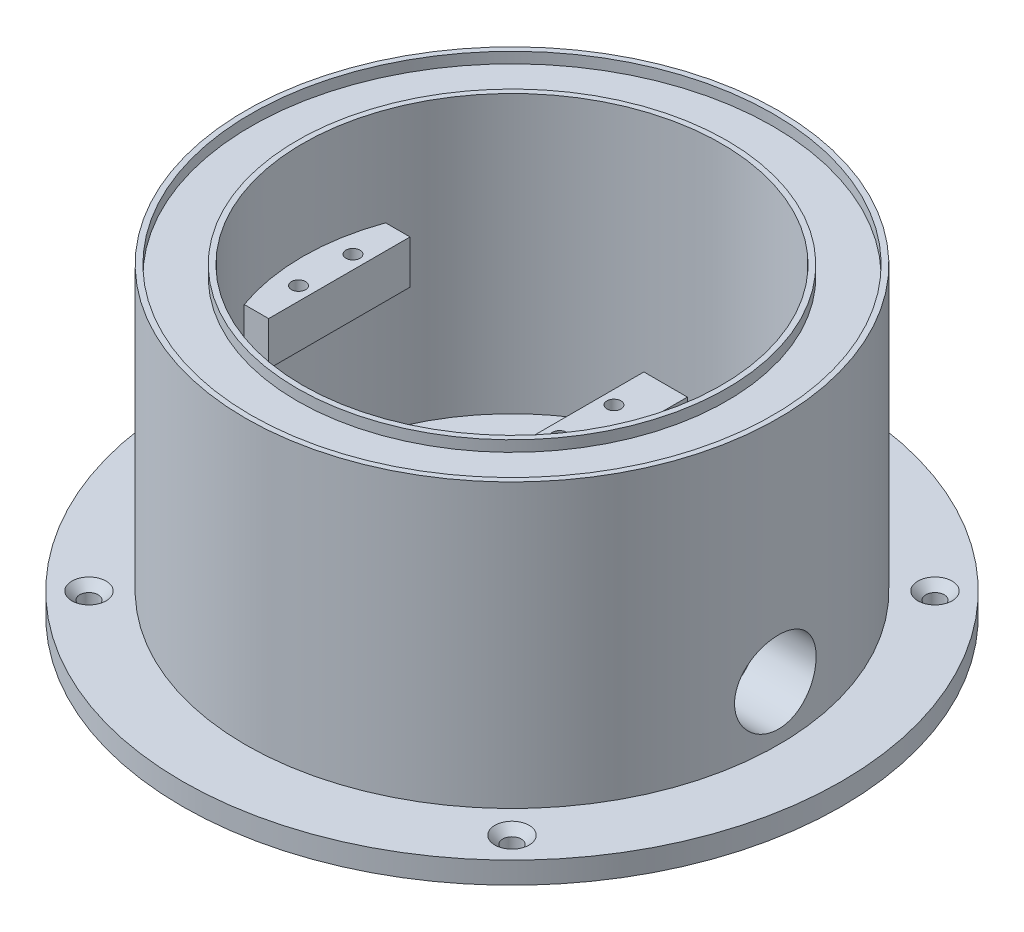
ISO-10303-21;
HEADER;
FILE_DESCRIPTION(('STEP AP214'),'2;1');
FILE_NAME('part.step','',(''),(''),'','','');
FILE_SCHEMA(('AUTOMOTIVE_DESIGN { 1 0 10303 214 1 1 1 1 }'));
ENDSEC;
DATA;
#1=APPLICATION_CONTEXT('core data for automotive mechanical design processes');
#2=APPLICATION_PROTOCOL_DEFINITION('international standard','automotive_design',2000,#1);
#3=PRODUCT_CONTEXT('',#1,'mechanical');
#4=PRODUCT('Part','Part','',(#3));
#5=PRODUCT_RELATED_PRODUCT_CATEGORY('part','',(#4));
#6=PRODUCT_DEFINITION_FORMATION('','',#4);
#7=PRODUCT_DEFINITION_CONTEXT('part definition',#1,'design');
#8=PRODUCT_DEFINITION('design','',#6,#7);
#9=PRODUCT_DEFINITION_SHAPE('','',#8);
#10=(LENGTH_UNIT() NAMED_UNIT(*) SI_UNIT(.MILLI.,.METRE.));
#11=(NAMED_UNIT(*) PLANE_ANGLE_UNIT() SI_UNIT($,.RADIAN.));
#12=(NAMED_UNIT(*) SI_UNIT($,.STERADIAN.) SOLID_ANGLE_UNIT());
#13=UNCERTAINTY_MEASURE_WITH_UNIT(LENGTH_MEASURE(1.E-05),#10,'distance_accuracy_value','');
#14=(GEOMETRIC_REPRESENTATION_CONTEXT(3) GLOBAL_UNCERTAINTY_ASSIGNED_CONTEXT((#13)) GLOBAL_UNIT_ASSIGNED_CONTEXT((#10,
#11,#12)) REPRESENTATION_CONTEXT('',''));
#15=CARTESIAN_POINT('',(0.,0.,0.));
#16=DIRECTION('',(0.,0.,1.));
#17=DIRECTION('',(1.,0.,0.));
#18=AXIS2_PLACEMENT_3D('',#15,#16,#17);
#19=CARTESIAN_POINT('',(0.,56.,0.));
#20=DIRECTION('',(0.,1.,0.));
#21=DIRECTION('',(0.,0.,1.));
#22=AXIS2_PLACEMENT_3D('',#19,#20,#21);
#23=PLANE('',#22);
#24=CARTESIAN_POINT('',(0.,56.,0.));
#25=DIRECTION('',(0.,1.,0.));
#26=DIRECTION('',(0.,0.,1.));
#27=AXIS2_PLACEMENT_3D('',#24,#25,#26);
#28=CIRCLE('',#27,38.5);
#29=CARTESIAN_POINT('',(0.,56.,38.5));
#30=VERTEX_POINT('',#29);
#31=EDGE_CURVE('E315',#30,#30,#28,.T.);
#32=ORIENTED_EDGE('',*,*,#31,.F.);
#33=EDGE_LOOP('',(#32));
#34=FACE_BOUND('',#33,.T.);
#35=CARTESIAN_POINT('',(0.,56.,0.));
#36=DIRECTION('',(0.,1.,0.));
#37=DIRECTION('',(0.,0.,1.));
#38=AXIS2_PLACEMENT_3D('',#35,#36,#37);
#39=CIRCLE('',#38,39.5);
#40=CARTESIAN_POINT('',(0.,56.,39.5));
#41=VERTEX_POINT('',#40);
#42=EDGE_CURVE('E49',#41,#41,#39,.T.);
#43=ORIENTED_EDGE('',*,*,#42,.T.);
#44=EDGE_LOOP('',(#43));
#45=FACE_BOUND('',#44,.T.);
#46=ADVANCED_FACE('F45',(#34,#45),#23,.T.);
#47=CARTESIAN_POINT('',(-34.25,30.8,-5.));
#48=DIRECTION('',(0.,1.,0.));
#49=DIRECTION('',(-1.,0.,0.));
#50=AXIS2_PLACEMENT_3D('',#47,#48,#49);
#51=PLANE('',#50);
#52=CARTESIAN_POINT('',(-34.25,30.8,-5.));
#53=DIRECTION('',(0.,1.,0.));
#54=DIRECTION('',(-1.,0.,0.));
#55=AXIS2_PLACEMENT_3D('',#52,#53,#54);
#56=CIRCLE('',#55,1.3);
#57=CARTESIAN_POINT('',(-35.55,30.8,-5.));
#58=VERTEX_POINT('',#57);
#59=EDGE_CURVE('E526',#58,#58,#56,.T.);
#60=ORIENTED_EDGE('',*,*,#59,.T.);
#61=EDGE_LOOP('',(#60));
#62=FACE_BOUND('',#61,.T.);
#63=ADVANCED_FACE('F307',(#62),#51,.T.);
#64=CARTESIAN_POINT('',(-34.25,30.8,5.));
#65=DIRECTION('',(0.,1.,0.));
#66=DIRECTION('',(-1.,0.,0.));
#67=AXIS2_PLACEMENT_3D('',#64,#65,#66);
#68=PLANE('',#67);
#69=CARTESIAN_POINT('',(-34.25,30.8,5.));
#70=DIRECTION('',(0.,1.,0.));
#71=DIRECTION('',(-1.,0.,0.));
#72=AXIS2_PLACEMENT_3D('',#69,#70,#71);
#73=CIRCLE('',#72,1.3);
#74=CARTESIAN_POINT('',(-35.55,30.8,5.));
#75=VERTEX_POINT('',#74);
#76=EDGE_CURVE('E238',#75,#75,#73,.T.);
#77=ORIENTED_EDGE('',*,*,#76,.T.);
#78=EDGE_LOOP('',(#77));
#79=FACE_BOUND('',#78,.T.);
#80=ADVANCED_FACE('F254',(#79),#68,.T.);
#81=CARTESIAN_POINT('',(0.,4.,0.));
#82=DIRECTION('',(0.,1.,0.));
#83=DIRECTION('',(0.,0.,1.));
#84=AXIS2_PLACEMENT_3D('',#81,#82,#83);
#85=PLANE('',#84);
#86=CARTESIAN_POINT('',(-38.8908729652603,4.,-38.8908729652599));
#87=DIRECTION('',(0.,1.,0.));
#88=DIRECTION('',(0.,0.,1.));
#89=AXIS2_PLACEMENT_3D('',#86,#87,#88);
#90=CIRCLE('',#89,3.15);
#91=CARTESIAN_POINT('',(-38.8908729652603,4.,-35.7408729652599));
#92=VERTEX_POINT('',#91);
#93=EDGE_CURVE('E180',#92,#92,#90,.T.);
#94=ORIENTED_EDGE('',*,*,#93,.F.);
#95=EDGE_LOOP('',(#94));
#96=FACE_BOUND('',#95,.T.);
#97=CARTESIAN_POINT('',(-38.8908729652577,4.,38.8908729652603));
#98=DIRECTION('',(0.,1.,0.));
#99=DIRECTION('',(0.,0.,1.));
#100=AXIS2_PLACEMENT_3D('',#97,#98,#99);
#101=CIRCLE('',#100,3.15);
#102=CARTESIAN_POINT('',(-38.8908729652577,4.,42.0408729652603));
#103=VERTEX_POINT('',#102);
#104=EDGE_CURVE('E192',#103,#103,#101,.T.);
#105=ORIENTED_EDGE('',*,*,#104,.F.);
#106=EDGE_LOOP('',(#105));
#107=FACE_BOUND('',#106,.T.);
#108=CARTESIAN_POINT('',(38.8908729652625,4.,38.8908729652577));
#109=DIRECTION('',(0.,1.,0.));
#110=DIRECTION('',(0.,0.,1.));
#111=AXIS2_PLACEMENT_3D('',#108,#109,#110);
#112=CIRCLE('',#111,3.15);
#113=CARTESIAN_POINT('',(38.8908729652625,4.,42.0408729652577));
#114=VERTEX_POINT('',#113);
#115=EDGE_CURVE('E204',#114,#114,#112,.T.);
#116=ORIENTED_EDGE('',*,*,#115,.F.);
#117=EDGE_LOOP('',(#116));
#118=FACE_BOUND('',#117,.T.);
#119=CARTESIAN_POINT('',(38.8908729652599,4.,-38.8908729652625));
#120=DIRECTION('',(0.,1.,0.));
#121=DIRECTION('',(0.,0.,1.));
#122=AXIS2_PLACEMENT_3D('',#119,#120,#121);
#123=CIRCLE('',#122,3.15);
#124=CARTESIAN_POINT('',(38.8908729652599,4.,-35.7408729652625));
#125=VERTEX_POINT('',#124);
#126=EDGE_CURVE('E215',#125,#125,#123,.T.);
#127=ORIENTED_EDGE('',*,*,#126,.F.);
#128=EDGE_LOOP('',(#127));
#129=FACE_BOUND('',#128,.T.);
#130=CARTESIAN_POINT('',(0.,4.,0.));
#131=DIRECTION('',(0.,1.,0.));
#132=DIRECTION('',(0.,0.,1.));
#133=AXIS2_PLACEMENT_3D('',#130,#131,#132);
#134=CIRCLE('',#133,60.625);
#135=CARTESIAN_POINT('',(0.,4.,60.625));
#136=VERTEX_POINT('',#135);
#137=EDGE_CURVE('E145',#136,#136,#134,.T.);
#138=ORIENTED_EDGE('',*,*,#137,.T.);
#139=EDGE_LOOP('',(#138));
#140=FACE_BOUND('',#139,.T.);
#141=CARTESIAN_POINT('',(0.,4.,0.));
#142=DIRECTION('',(0.,1.,0.));
#143=DIRECTION('',(0.,0.,1.));
#144=AXIS2_PLACEMENT_3D('',#141,#142,#143);
#145=CIRCLE('',#144,49.);
#146=CARTESIAN_POINT('',(0.,4.,49.));
#147=VERTEX_POINT('',#146);
#148=EDGE_CURVE('E420',#147,#147,#145,.T.);
#149=ORIENTED_EDGE('',*,*,#148,.F.);
#150=EDGE_LOOP('',(#149));
#151=FACE_BOUND('',#150,.T.);
#152=ADVANCED_FACE('F438',(#96,#107,#118,#129,#140,#151),#85,.T.);
#153=CARTESIAN_POINT('',(-34.25,30.8,-5.));
#154=DIRECTION('',(0.,1.,0.));
#155=DIRECTION('',(-1.,0.,0.));
#156=AXIS2_PLACEMENT_3D('',#153,#154,#155);
#157=CYLINDRICAL_SURFACE('',#156,1.3);
#158=ORIENTED_EDGE('',*,*,#59,.F.);
#159=EDGE_LOOP('',(#158));
#160=FACE_BOUND('',#159,.T.);
#161=CARTESIAN_POINT('',(-34.25,38.,-5.));
#162=DIRECTION('',(0.,1.,0.));
#163=DIRECTION('',(-1.,0.,0.));
#164=AXIS2_PLACEMENT_3D('',#161,#162,#163);
#165=CIRCLE('',#164,1.3);
#166=CARTESIAN_POINT('',(-35.55,38.,-5.));
#167=VERTEX_POINT('',#166);
#168=EDGE_CURVE('E522',#167,#167,#165,.T.);
#169=ORIENTED_EDGE('',*,*,#168,.T.);
#170=EDGE_LOOP('',(#169));
#171=FACE_BOUND('',#170,.T.);
#172=ADVANCED_FACE('F275',(#160,#171),#157,.F.);
#173=CARTESIAN_POINT('',(-34.25,30.8,5.));
#174=DIRECTION('',(0.,1.,0.));
#175=DIRECTION('',(-1.,0.,0.));
#176=AXIS2_PLACEMENT_3D('',#173,#174,#175);
#177=CYLINDRICAL_SURFACE('',#176,1.3);
#178=ORIENTED_EDGE('',*,*,#76,.F.);
#179=EDGE_LOOP('',(#178));
#180=FACE_BOUND('',#179,.T.);
#181=CARTESIAN_POINT('',(-34.25,38.,5.));
#182=DIRECTION('',(0.,1.,0.));
#183=DIRECTION('',(-1.,0.,0.));
#184=AXIS2_PLACEMENT_3D('',#181,#182,#183);
#185=CIRCLE('',#184,1.3);
#186=CARTESIAN_POINT('',(-35.55,38.,5.));
#187=VERTEX_POINT('',#186);
#188=EDGE_CURVE('E237',#187,#187,#185,.T.);
#189=ORIENTED_EDGE('',*,*,#188,.T.);
#190=EDGE_LOOP('',(#189));
#191=FACE_BOUND('',#190,.T.);
#192=ADVANCED_FACE('F292',(#180,#191),#177,.F.);
#193=CARTESIAN_POINT('',(-31.75,0.,13.));
#194=DIRECTION('',(1.,0.,0.));
#195=DIRECTION('',(0.,0.,-1.));
#196=AXIS2_PLACEMENT_3D('',#193,#194,#195);
#197=PLANE('',#196);
#198=DIRECTION('',(0.,-1.,0.));
#199=VECTOR('',#198,1.);
#200=CARTESIAN_POINT('',(-31.75,0.,-13.));
#201=LINE('',#200,#199);
#202=CARTESIAN_POINT('',(-31.75,38.,-13.));
#203=VERTEX_POINT('',#202);
#204=CARTESIAN_POINT('',(-31.75,30.,-13.));
#205=VERTEX_POINT('',#204);
#206=EDGE_CURVE('E560',#203,#205,#201,.T.);
#207=ORIENTED_EDGE('',*,*,#206,.F.);
#208=DIRECTION('',(0.,0.,-1.));
#209=VECTOR('',#208,1.);
#210=CARTESIAN_POINT('',(-31.75,38.,13.));
#211=LINE('',#210,#209);
#212=CARTESIAN_POINT('',(-31.75,38.,13.));
#213=VERTEX_POINT('',#212);
#214=EDGE_CURVE('E414',#213,#203,#211,.T.);
#215=ORIENTED_EDGE('',*,*,#214,.F.);
#216=DIRECTION('',(0.,-1.,0.));
#217=VECTOR('',#216,1.);
#218=CARTESIAN_POINT('',(-31.75,0.,13.));
#219=LINE('',#218,#217);
#220=CARTESIAN_POINT('',(-31.75,30.,13.));
#221=VERTEX_POINT('',#220);
#222=EDGE_CURVE('E415',#213,#221,#219,.T.);
#223=ORIENTED_EDGE('',*,*,#222,.T.);
#224=DIRECTION('',(0.,0.,-1.));
#225=VECTOR('',#224,1.);
#226=CARTESIAN_POINT('',(-31.75,30.,13.));
#227=LINE('',#226,#225);
#228=EDGE_CURVE('E422',#221,#205,#227,.T.);
#229=ORIENTED_EDGE('',*,*,#228,.T.);
#230=EDGE_LOOP('',(#207,#215,#223,#229));
#231=FACE_BOUND('',#230,.T.);
#232=ADVANCED_FACE('F289',(#231),#197,.T.);
#233=CARTESIAN_POINT('',(0.,56.,0.));
#234=DIRECTION('',(0.,-1.,0.));
#235=DIRECTION('',(0.,0.,-1.));
#236=AXIS2_PLACEMENT_3D('',#233,#234,#235);
#237=CYLINDRICAL_SURFACE('',#236,49.);
#238=CARTESIAN_POINT('',(48.422618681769,14.,-7.5));
#239=CARTESIAN_POINT('',(48.4226174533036,13.7906164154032,-7.50000292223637));
#240=CARTESIAN_POINT('',(48.4239794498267,13.5812734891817,-7.49122882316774));
#241=CARTESIAN_POINT('',(48.4293853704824,13.1640245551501,-7.4562031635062));
#242=CARTESIAN_POINT('',(48.433429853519,12.9561188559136,-7.42994796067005));
#243=CARTESIAN_POINT('',(48.4440886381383,12.543163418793,-7.36013016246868));
#244=CARTESIAN_POINT('',(48.4507046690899,12.3381156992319,-7.31655591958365));
#245=CARTESIAN_POINT('',(48.4663170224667,11.932394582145,-7.21241191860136));
#246=CARTESIAN_POINT('',(48.4753142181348,11.7317228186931,-7.15183592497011));
#247=CARTESIAN_POINT('',(48.495416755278,11.3364757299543,-7.01422684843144));
#248=CARTESIAN_POINT('',(48.5065196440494,11.1418936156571,-6.93721289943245));
#249=CARTESIAN_POINT('',(48.5305277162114,10.7598639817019,-6.76721848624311));
#250=CARTESIAN_POINT('',(48.5434335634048,10.5724191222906,-6.67423213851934));
#251=CARTESIAN_POINT('',(48.5706716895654,10.2061240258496,-6.47303225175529));
#252=CARTESIAN_POINT('',(48.5850032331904,10.0272694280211,-6.36482655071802));
#253=CARTESIAN_POINT('',(48.6147011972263,9.67920651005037,-6.13387172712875));
#254=CARTESIAN_POINT('',(48.6300680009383,9.51000180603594,-6.01111720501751));
#255=CARTESIAN_POINT('',(48.6615139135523,9.18129727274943,-5.75102925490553));
#256=CARTESIAN_POINT('',(48.6775972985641,9.02187471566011,-5.61359867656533));
#257=CARTESIAN_POINT('',(48.7099269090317,8.7150910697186,-5.3257856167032));
#258=CARTESIAN_POINT('',(48.7261731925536,8.56773446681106,-5.17539836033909));
#259=CARTESIAN_POINT('',(48.7583616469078,8.28621095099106,-4.86280203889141));
#260=CARTESIAN_POINT('',(48.774303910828,8.15203994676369,-4.70059666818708));
#261=CARTESIAN_POINT('',(48.8054487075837,7.89772486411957,-4.36537702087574));
#262=CARTESIAN_POINT('',(48.8206509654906,7.77758597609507,-4.19235878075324));
#263=CARTESIAN_POINT('',(48.8499539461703,7.55169722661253,-3.83589986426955));
#264=CARTESIAN_POINT('',(48.8640489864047,7.44601975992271,-3.65241283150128));
#265=CARTESIAN_POINT('',(48.8906556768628,7.25051137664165,-3.2770688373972));
#266=CARTESIAN_POINT('',(48.9031673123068,7.16068060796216,-3.08521179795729));
#267=CARTESIAN_POINT('',(48.9262503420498,6.9975363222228,-2.69449766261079));
#268=CARTESIAN_POINT('',(48.9368218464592,6.92422186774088,-2.49564096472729));
#269=CARTESIAN_POINT('',(48.9557236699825,6.79465535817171,-2.09233596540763));
#270=CARTESIAN_POINT('',(48.9640539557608,6.7384035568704,-1.88788758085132));
#271=CARTESIAN_POINT('',(48.9781774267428,6.64377552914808,-1.47653133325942));
#272=CARTESIAN_POINT('',(48.9839903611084,6.60526000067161,-1.26965619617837));
#273=CARTESIAN_POINT('',(48.9930128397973,6.54572803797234,-0.853276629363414));
#274=CARTESIAN_POINT('',(48.9962214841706,6.5247176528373,-0.643771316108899));
#275=CARTESIAN_POINT('',(48.9999383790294,6.50039176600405,-0.223783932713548));
#276=CARTESIAN_POINT('',(49.0004477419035,6.49706897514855,-0.0133023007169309));
#277=CARTESIAN_POINT('',(48.9987606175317,6.5081039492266,0.407207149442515));
#278=CARTESIAN_POINT('',(48.9965631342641,6.52246822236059,0.617234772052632));
#279=CARTESIAN_POINT('',(48.986034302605,6.59161953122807,1.24068654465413));
#280=CARTESIAN_POINT('',(48.9738001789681,6.67223919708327,1.65149443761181));
#281=CARTESIAN_POINT('',(48.9401896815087,6.90037675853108,2.45345253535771));
#282=CARTESIAN_POINT('',(48.9188130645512,7.04789643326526,2.84460221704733));
#283=CARTESIAN_POINT('',(48.8691731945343,7.40624603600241,3.59820350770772));
#284=CARTESIAN_POINT('',(48.8408832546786,7.61732205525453,3.96053651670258));
#285=CARTESIAN_POINT('',(48.7805662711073,8.09661236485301,4.64484508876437));
#286=CARTESIAN_POINT('',(48.7485389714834,8.36483056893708,4.96681788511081));
#287=CARTESIAN_POINT('',(48.6839306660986,8.95405785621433,5.56474767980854));
#288=CARTESIAN_POINT('',(48.651347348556,9.27557933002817,5.84019978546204));
#289=CARTESIAN_POINT('',(48.5896186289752,9.96054800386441,6.33331802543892));
#290=CARTESIAN_POINT('',(48.5604732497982,10.3239954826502,6.55098377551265));
#291=CARTESIAN_POINT('',(48.5089206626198,11.0830359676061,6.92242580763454));
#292=CARTESIAN_POINT('',(48.4865190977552,11.4786555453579,7.07614862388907));
#293=CARTESIAN_POINT('',(48.4510891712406,12.2905175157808,7.31482435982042));
#294=CARTESIAN_POINT('',(48.4380601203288,12.7067583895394,7.39978233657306));
#295=CARTESIAN_POINT('',(48.4229815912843,13.5435502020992,7.49782143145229));
#296=CARTESIAN_POINT('',(48.4208226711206,13.9640152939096,7.51161903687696));
#297=CARTESIAN_POINT('',(48.4274382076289,14.8012527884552,7.46884706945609));
#298=CARTESIAN_POINT('',(48.436212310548,15.218025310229,7.41227977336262));
#299=CARTESIAN_POINT('',(48.4636042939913,16.0338143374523,7.23099661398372));
#300=CARTESIAN_POINT('',(48.4821704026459,16.4329123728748,7.10663905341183));
#301=CARTESIAN_POINT('',(48.5270128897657,17.2046086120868,6.79366155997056));
#302=CARTESIAN_POINT('',(48.5532896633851,17.5772054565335,6.60503833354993));
#303=CARTESIAN_POINT('',(48.6108452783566,18.2884877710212,6.16723172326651));
#304=CARTESIAN_POINT('',(48.6421616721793,18.6268848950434,5.91758575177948));
#305=CARTESIAN_POINT('',(48.7061729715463,19.2573580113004,5.36522161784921));
#306=CARTESIAN_POINT('',(48.7388679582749,19.5494312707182,5.06250032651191));
#307=CARTESIAN_POINT('',(48.7863375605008,19.9476356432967,4.57389549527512));
#308=CARTESIAN_POINT('',(48.8019700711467,20.0742314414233,4.40437179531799));
#309=CARTESIAN_POINT('',(48.8322231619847,20.312684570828,4.05519744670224));
#310=CARTESIAN_POINT('',(48.8468441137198,20.4245473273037,3.8755505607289));
#311=CARTESIAN_POINT('',(48.8746650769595,20.6327632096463,3.50731077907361));
#312=CARTESIAN_POINT('',(48.8878645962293,20.7291109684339,3.3187148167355));
#313=CARTESIAN_POINT('',(48.9124591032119,20.905525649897,2.93401932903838));
#314=CARTESIAN_POINT('',(48.9238547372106,20.9855984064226,2.73792252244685));
#315=CARTESIAN_POINT('',(48.9444844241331,21.1286429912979,2.34028487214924));
#316=CARTESIAN_POINT('',(48.9537261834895,21.1916759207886,2.13876640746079));
#317=CARTESIAN_POINT('',(48.9698385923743,21.3005474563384,1.73104774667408));
#318=CARTESIAN_POINT('',(48.976709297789,21.3463864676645,1.52484766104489));
#319=CARTESIAN_POINT('',(48.9878837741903,21.4205189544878,1.10925640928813));
#320=CARTESIAN_POINT('',(48.9921876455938,21.4488131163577,0.89986536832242));
#321=CARTESIAN_POINT('',(48.9981057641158,21.4876390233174,0.479408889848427));
#322=CARTESIAN_POINT('',(48.9997200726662,21.4981711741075,0.268343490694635));
#323=CARTESIAN_POINT('',(49.0002106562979,21.5013762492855,-0.151803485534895));
#324=CARTESIAN_POINT('',(48.9991142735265,21.4942275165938,-0.360883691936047));
#325=CARTESIAN_POINT('',(48.9942723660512,21.4625042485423,-0.777613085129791));
#326=CARTESIAN_POINT('',(48.9905277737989,21.4379358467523,-0.985262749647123));
#327=CARTESIAN_POINT('',(48.9804944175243,21.3715607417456,-1.39776280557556));
#328=CARTESIAN_POINT('',(48.9742052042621,21.3297509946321,-1.60261269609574));
#329=CARTESIAN_POINT('',(48.959258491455,21.2292088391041,-2.0080227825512));
#330=CARTESIAN_POINT('',(48.9506010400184,21.1704767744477,-2.20858306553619));
#331=CARTESIAN_POINT('',(48.9311665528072,21.0365787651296,-2.60385632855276));
#332=CARTESIAN_POINT('',(48.9203911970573,20.9614258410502,-2.79857380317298));
#333=CARTESIAN_POINT('',(48.8970150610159,20.7952077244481,-3.18097742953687));
#334=CARTESIAN_POINT('',(48.8844142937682,20.7041426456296,-3.3686636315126));
#335=CARTESIAN_POINT('',(48.8577321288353,20.5067311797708,-3.73575842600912));
#336=CARTESIAN_POINT('',(48.8436504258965,20.4003816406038,-3.91516530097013));
#337=CARTESIAN_POINT('',(48.8144012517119,20.1732040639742,-4.26437885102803));
#338=CARTESIAN_POINT('',(48.799234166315,20.0523811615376,-4.43418889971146));
#339=CARTESIAN_POINT('',(48.7680693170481,19.7957710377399,-4.76479440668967));
#340=CARTESIAN_POINT('',(48.752064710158,19.6598449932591,-4.92548148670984));
#341=CARTESIAN_POINT('',(48.7198219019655,19.3750396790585,-5.23480001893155));
#342=CARTESIAN_POINT('',(48.7035837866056,19.2261650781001,-5.38343577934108));
#343=CARTESIAN_POINT('',(48.6713138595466,18.9163539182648,-5.66777720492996));
#344=CARTESIAN_POINT('',(48.6552821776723,18.7554101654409,-5.80347504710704));
#345=CARTESIAN_POINT('',(48.6238927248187,18.4227089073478,-6.06084669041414));
#346=CARTESIAN_POINT('',(48.6085347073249,18.2509554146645,-6.18252564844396));
#347=CARTESIAN_POINT('',(48.5788285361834,17.8966562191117,-6.41177569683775));
#348=CARTESIAN_POINT('',(48.5644873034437,17.7140497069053,-6.51925373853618));
#349=CARTESIAN_POINT('',(48.5373405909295,17.3403801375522,-6.71838274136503));
#350=CARTESIAN_POINT('',(48.524534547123,17.149320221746,-6.81003952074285));
#351=CARTESIAN_POINT('',(48.5008334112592,16.7601660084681,-6.97683730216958));
#352=CARTESIAN_POINT('',(48.489936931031,16.5620769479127,-7.0519903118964));
#353=CARTESIAN_POINT('',(48.4703645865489,16.1602180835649,-7.18528223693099));
#354=CARTESIAN_POINT('',(48.4616882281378,15.9564495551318,-7.24342493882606));
#355=CARTESIAN_POINT('',(48.4439122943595,15.4643331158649,-7.3615406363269));
#356=CARTESIAN_POINT('',(48.4359643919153,15.1739579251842,-7.4134041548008));
#357=CARTESIAN_POINT('',(48.4253184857,14.5890283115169,-7.48263154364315));
#358=CARTESIAN_POINT('',(48.4226204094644,14.2944739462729,-7.49999589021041));
#359=CARTESIAN_POINT('',(48.422618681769,14.,-7.5));
#360=B_SPLINE_CURVE_WITH_KNOTS('',3,(#238,#239,#240,#241,#242,#243,#244,#245,#246,#247,#248,
#249,#250,#251,#252,#253,#254,#255,#256,#257,#258,#259,#260,#261,#262,#263,#264,#265,#266,#267,
#268,#269,#270,#271,#272,#273,#274,#275,#276,#277,#278,#279,#280,#281,#282,#283,#284,#285,#286,
#287,#288,#289,#290,#291,#292,#293,#294,#295,#296,#297,#298,#299,#300,#301,#302,#303,#304,#305,
#306,#307,#308,#309,#310,#311,#312,#313,#314,#315,#316,#317,#318,#319,#320,#321,#322,#323,#324,
#325,#326,#327,#328,#329,#330,#331,#332,#333,#334,#335,#336,#337,#338,#339,#340,#341,#342,#343,
#344,#345,#346,#347,#348,#349,#350,#351,#352,#353,#354,#355,#356,#357,#358,#359),.UNSPECIFIED.,
.T.,.F.,(4,2,2,2,2,2,2,2,2,2,2,2,2,2,2,2,2,2,2,2,2,2,2,2,2,2,2,2,2,2,2,2,2,2,2,2,2,2,2,2,2,2,2,
2,2,2,2,2,2,2,2,2,2,2,2,2,2,2,2,2,4),(0.,0.627892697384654,1.25591625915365,1.88436290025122,
2.51304033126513,3.14098992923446,3.76917133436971,4.39703040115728,5.02512322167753,
5.65766709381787,6.29044507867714,6.92302609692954,7.55584036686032,8.19171491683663,
8.82759540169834,9.46343978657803,10.099293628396,10.7300644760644,11.3610532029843,
11.9917818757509,12.6227427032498,13.872754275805,15.1227990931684,16.3777477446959,
17.632782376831,18.9006668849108,20.1685598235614,21.4375107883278,22.7063684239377,
23.962425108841,25.2184411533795,26.4678820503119,27.7173869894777,28.9766748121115,
30.2360368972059,30.8718753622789,31.5074790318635,32.1433021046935,32.7788968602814,
33.4121813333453,34.0454508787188,34.6786956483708,35.3119259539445,35.9387951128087,
36.5654436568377,37.1922028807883,37.8189493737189,38.4452006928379,39.0714475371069,
39.6978237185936,40.3239783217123,40.9564575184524,41.5887096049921,42.2213415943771,
42.8537401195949,43.4900960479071,44.1262174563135,44.761874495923,45.3973899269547,
46.2804610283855,47.1635199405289),.UNSPECIFIED.);
#361=CARTESIAN_POINT('',(48.422618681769,14.,-7.5));
#362=VERTEX_POINT('',#361);
#363=EDGE_CURVE('E228',#362,#362,#360,.T.);
#364=ORIENTED_EDGE('',*,*,#363,.T.);
#365=EDGE_LOOP('',(#364));
#366=FACE_BOUND('',#365,.T.);
#367=CARTESIAN_POINT('',(0.,56.,0.));
#368=DIRECTION('',(0.,1.,0.));
#369=DIRECTION('',(0.,0.,1.));
#370=AXIS2_PLACEMENT_3D('',#367,#368,#369);
#371=CIRCLE('',#370,49.);
#372=CARTESIAN_POINT('',(0.,56.,49.));
#373=VERTEX_POINT('',#372);
#374=EDGE_CURVE('E418',#373,#373,#371,.T.);
#375=ORIENTED_EDGE('',*,*,#374,.F.);
#376=EDGE_LOOP('',(#375));
#377=FACE_BOUND('',#376,.T.);
#378=ORIENTED_EDGE('',*,*,#148,.T.);
#379=EDGE_LOOP('',(#378));
#380=FACE_BOUND('',#379,.T.);
#381=ADVANCED_FACE('F240',(#366,#377,#380),#237,.T.);
#382=CARTESIAN_POINT('',(0.,4.,0.));
#383=DIRECTION('',(0.,-1.,0.));
#384=DIRECTION('',(0.,0.,-1.));
#385=AXIS2_PLACEMENT_3D('',#382,#383,#384);
#386=CYLINDRICAL_SURFACE('',#385,60.625);
#387=ORIENTED_EDGE('',*,*,#137,.F.);
#388=EDGE_LOOP('',(#387));
#389=FACE_BOUND('',#388,.T.);
#390=CARTESIAN_POINT('',(0.,0.,0.));
#391=DIRECTION('',(0.,1.,0.));
#392=DIRECTION('',(0.,0.,1.));
#393=AXIS2_PLACEMENT_3D('',#390,#391,#392);
#394=CIRCLE('',#393,60.625);
#395=CARTESIAN_POINT('',(0.,0.,60.625));
#396=VERTEX_POINT('',#395);
#397=EDGE_CURVE('E266',#396,#396,#394,.T.);
#398=ORIENTED_EDGE('',*,*,#397,.T.);
#399=EDGE_LOOP('',(#398));
#400=FACE_BOUND('',#399,.T.);
#401=ADVANCED_FACE('F298',(#389,#400),#386,.T.);
#402=CARTESIAN_POINT('',(0.,56.,0.));
#403=DIRECTION('',(0.,1.,0.));
#404=DIRECTION('',(0.,0.,1.));
#405=AXIS2_PLACEMENT_3D('',#402,#403,#404);
#406=CIRCLE('',#405,48.);
#407=CARTESIAN_POINT('',(0.,56.,48.));
#408=VERTEX_POINT('',#407);
#409=EDGE_CURVE('E323',#408,#408,#406,.T.);
#410=ORIENTED_EDGE('',*,*,#409,.F.);
#411=EDGE_LOOP('',(#410));
#412=FACE_BOUND('',#411,.T.);
#413=ORIENTED_EDGE('',*,*,#374,.T.);
#414=EDGE_LOOP('',(#413));
#415=FACE_BOUND('',#414,.T.);
#416=ADVANCED_FACE('F295',(#412,#415),#23,.T.);
#417=CARTESIAN_POINT('',(-30.875,30.875,13.));
#418=DIRECTION('',(0.707106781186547,-0.707106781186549,0.));
#419=DIRECTION('',(0.707106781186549,0.707106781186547,0.));
#420=AXIS2_PLACEMENT_3D('',#417,#418,#419);
#421=PLANE('',#420);
#422=DIRECTION('',(-0.707106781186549,-0.707106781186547,0.));
#423=VECTOR('',#422,1.);
#424=CARTESIAN_POINT('',(-30.875,30.875,13.));
#425=LINE('',#424,#423);
#426=CARTESIAN_POINT('',(-36.2387913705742,25.5112086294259,13.));
#427=VERTEX_POINT('',#426);
#428=EDGE_CURVE('E551',#221,#427,#425,.T.);
#429=ORIENTED_EDGE('',*,*,#428,.T.);
#430=CARTESIAN_POINT('',(0.,61.75,0.));
#431=DIRECTION('',(0.707106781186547,-0.707106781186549,0.));
#432=DIRECTION('',(0.707106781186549,0.707106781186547,0.));
#433=AXIS2_PLACEMENT_3D('',#430,#431,#432);
#434=ELLIPSE('',#433,54.4472221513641,38.5);
#435=CARTESIAN_POINT('',(-36.2387913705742,25.5112086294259,-13.));
#436=VERTEX_POINT('',#435);
#437=EDGE_CURVE('E544',#427,#436,#434,.T.);
#438=ORIENTED_EDGE('',*,*,#437,.T.);
#439=DIRECTION('',(-0.707106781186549,-0.707106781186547,0.));
#440=VECTOR('',#439,1.);
#441=CARTESIAN_POINT('',(-30.875,30.875,-13.));
#442=LINE('',#441,#440);
#443=EDGE_CURVE('E550',#205,#436,#442,.T.);
#444=ORIENTED_EDGE('',*,*,#443,.F.);
#445=ORIENTED_EDGE('',*,*,#228,.F.);
#446=EDGE_LOOP('',(#429,#438,#444,#445));
#447=FACE_BOUND('',#446,.T.);
#448=ADVANCED_FACE('F284',(#447),#421,.T.);
#449=CARTESIAN_POINT('',(0.,0.,-13.));
#450=DIRECTION('',(0.,0.,1.));
#451=DIRECTION('',(1.,0.,0.));
#452=AXIS2_PLACEMENT_3D('',#449,#450,#451);
#453=PLANE('',#452);
#454=DIRECTION('',(0.,1.,0.));
#455=VECTOR('',#454,1.);
#456=CARTESIAN_POINT('',(-36.2387913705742,-127.600892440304,-13.));
#457=LINE('',#456,#455);
#458=CARTESIAN_POINT('',(-36.2387913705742,38.,-13.));
#459=VERTEX_POINT('',#458);
#460=EDGE_CURVE('E537',#459,#436,#457,.F.);
#461=ORIENTED_EDGE('',*,*,#460,.F.);
#462=DIRECTION('',(-1.,0.,0.));
#463=VECTOR('',#462,1.);
#464=CARTESIAN_POINT('',(0.,38.,-13.));
#465=LINE('',#464,#463);
#466=EDGE_CURVE('E555',#203,#459,#465,.T.);
#467=ORIENTED_EDGE('',*,*,#466,.F.);
#468=ORIENTED_EDGE('',*,*,#206,.T.);
#469=ORIENTED_EDGE('',*,*,#443,.T.);
#470=EDGE_LOOP('',(#461,#467,#468,#469));
#471=FACE_BOUND('',#470,.T.);
#472=ADVANCED_FACE('F281',(#471),#453,.F.);
#473=CARTESIAN_POINT('',(0.,38.,13.));
#474=DIRECTION('',(0.,-1.,0.));
#475=DIRECTION('',(0.,0.,-1.));
#476=AXIS2_PLACEMENT_3D('',#473,#474,#475);
#477=PLANE('',#476);
#478=ORIENTED_EDGE('',*,*,#188,.F.);
#479=EDGE_LOOP('',(#478));
#480=FACE_BOUND('',#479,.T.);
#481=ORIENTED_EDGE('',*,*,#168,.F.);
#482=EDGE_LOOP('',(#481));
#483=FACE_BOUND('',#482,.T.);
#484=CARTESIAN_POINT('',(0.,38.,0.));
#485=DIRECTION('',(0.,-1.,0.));
#486=DIRECTION('',(0.,0.,-1.));
#487=AXIS2_PLACEMENT_3D('',#484,#485,#486);
#488=CIRCLE('',#487,38.5);
#489=CARTESIAN_POINT('',(-36.2387913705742,38.,13.));
#490=VERTEX_POINT('',#489);
#491=EDGE_CURVE('E540',#490,#459,#488,.T.);
#492=ORIENTED_EDGE('',*,*,#491,.F.);
#493=DIRECTION('',(-1.,0.,0.));
#494=VECTOR('',#493,1.);
#495=CARTESIAN_POINT('',(0.,38.,13.));
#496=LINE('',#495,#494);
#497=EDGE_CURVE('E411',#213,#490,#496,.T.);
#498=ORIENTED_EDGE('',*,*,#497,.F.);
#499=ORIENTED_EDGE('',*,*,#214,.T.);
#500=ORIENTED_EDGE('',*,*,#466,.T.);
#501=EDGE_LOOP('',(#492,#498,#499,#500));
#502=FACE_BOUND('',#501,.T.);
#503=ADVANCED_FACE('F279',(#480,#483,#502),#477,.F.);
#504=CARTESIAN_POINT('',(0.,0.,13.));
#505=DIRECTION('',(0.,0.,1.));
#506=DIRECTION('',(1.,0.,0.));
#507=AXIS2_PLACEMENT_3D('',#504,#505,#506);
#508=PLANE('',#507);
#509=ORIENTED_EDGE('',*,*,#497,.T.);
#510=DIRECTION('',(0.,1.,0.));
#511=VECTOR('',#510,1.);
#512=CARTESIAN_POINT('',(-36.2387913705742,-127.600892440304,13.));
#513=LINE('',#512,#511);
#514=EDGE_CURVE('E547',#490,#427,#513,.F.);
#515=ORIENTED_EDGE('',*,*,#514,.T.);
#516=ORIENTED_EDGE('',*,*,#428,.F.);
#517=ORIENTED_EDGE('',*,*,#222,.F.);
#518=EDGE_LOOP('',(#509,#515,#516,#517));
#519=FACE_BOUND('',#518,.T.);
#520=ADVANCED_FACE('F250',(#519),#508,.T.);
#521=CARTESIAN_POINT('',(29.,14.,0.));
#522=DIRECTION('',(1.,0.,0.));
#523=DIRECTION('',(0.,0.,-1.));
#524=AXIS2_PLACEMENT_3D('',#521,#522,#523);
#525=CYLINDRICAL_SURFACE('',#524,7.5);
#526=CARTESIAN_POINT('',(37.7624151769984,14.,-7.5));
#527=CARTESIAN_POINT('',(37.7624130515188,14.208553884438,-7.50000400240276));
#528=CARTESIAN_POINT('',(37.7641461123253,14.4170571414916,-7.49129870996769));
#529=CARTESIAN_POINT('',(37.77102247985,14.832620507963,-7.45655417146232));
#530=CARTESIAN_POINT('',(37.7761663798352,15.0396803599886,-7.43051190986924));
#531=CARTESIAN_POINT('',(37.789719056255,15.4509102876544,-7.36127494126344));
#532=CARTESIAN_POINT('',(37.7981295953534,15.6550787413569,-7.31807097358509));
#533=CARTESIAN_POINT('',(37.8179713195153,16.0590453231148,-7.21483246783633));
#534=CARTESIAN_POINT('',(37.8294036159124,16.258841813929,-7.15479173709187));
#535=CARTESIAN_POINT('',(37.8549376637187,16.6523204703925,-7.01843954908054));
#536=CARTESIAN_POINT('',(37.8690357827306,16.8460105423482,-6.94215021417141));
#537=CARTESIAN_POINT('',(37.8995130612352,17.2263031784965,-6.77378963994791));
#538=CARTESIAN_POINT('',(37.9158930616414,17.4129030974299,-6.68171257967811));
#539=CARTESIAN_POINT('',(37.9504587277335,17.7775999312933,-6.48250658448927));
#540=CARTESIAN_POINT('',(37.9686435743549,17.9557006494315,-6.37538446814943));
#541=CARTESIAN_POINT('',(38.0063243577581,18.3023712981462,-6.14676581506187));
#542=CARTESIAN_POINT('',(38.0258207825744,18.4709376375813,-6.02526391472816));
#543=CARTESIAN_POINT('',(38.0658123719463,18.7992640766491,-5.76724922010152));
#544=CARTESIAN_POINT('',(38.0863165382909,18.9588984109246,-5.63057775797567));
#545=CARTESIAN_POINT('',(38.1275423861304,19.2661831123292,-5.34428934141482));
#546=CARTESIAN_POINT('',(38.1482641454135,19.4138290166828,-5.19466760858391));
#547=CARTESIAN_POINT('',(38.1893340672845,19.6960270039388,-4.88358120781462));
#548=CARTESIAN_POINT('',(38.209682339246,19.8305829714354,-4.7221200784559));
#549=CARTESIAN_POINT('',(38.2494536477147,20.0857703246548,-4.38834226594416));
#550=CARTESIAN_POINT('',(38.2688763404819,20.2063965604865,-4.21602160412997));
#551=CARTESIAN_POINT('',(38.3063995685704,20.4337332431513,-3.86030933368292));
#552=CARTESIAN_POINT('',(38.3244881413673,20.5403232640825,-3.6768394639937));
#553=CARTESIAN_POINT('',(38.3586552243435,20.7376463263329,-3.30137832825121));
#554=CARTESIAN_POINT('',(38.3747337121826,20.8283791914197,-3.10938696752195));
#555=CARTESIAN_POINT('',(38.4044210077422,20.9932921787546,-2.71825411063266));
#556=CARTESIAN_POINT('',(38.4180300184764,21.0674736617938,-2.51911320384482));
#557=CARTESIAN_POINT('',(38.4423898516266,21.1987151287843,-2.11509194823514));
#558=CARTESIAN_POINT('',(38.4531406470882,21.2557749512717,-1.91021154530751));
#559=CARTESIAN_POINT('',(38.4713588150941,21.3517100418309,-1.49880433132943));
#560=CARTESIAN_POINT('',(38.4788656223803,21.3908041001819,-1.29233027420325));
#561=CARTESIAN_POINT('',(38.4905772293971,21.4515384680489,-0.876740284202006));
#562=CARTESIAN_POINT('',(38.4947820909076,21.4731791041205,-0.667624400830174));
#563=CARTESIAN_POINT('',(38.4997703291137,21.498831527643,-0.248289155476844));
#564=CARTESIAN_POINT('',(38.5005539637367,21.5028446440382,-0.038069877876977));
#565=CARTESIAN_POINT('',(38.4986781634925,21.4932131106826,0.381947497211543));
#566=CARTESIAN_POINT('',(38.4960187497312,21.4795685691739,0.591745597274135));
#567=CARTESIAN_POINT('',(38.4873921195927,21.4350400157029,1.00652192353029));
#568=CARTESIAN_POINT('',(38.4814707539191,21.4043949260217,1.21152679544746));
#569=CARTESIAN_POINT('',(38.4665138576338,21.3262647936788,1.61825486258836));
#570=CARTESIAN_POINT('',(38.4574772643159,21.2787740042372,1.81997691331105));
#571=CARTESIAN_POINT('',(38.4365396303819,21.1673269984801,2.21860771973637));
#572=CARTESIAN_POINT('',(38.4246395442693,21.1033762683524,2.41551805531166));
#573=CARTESIAN_POINT('',(38.3983020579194,20.9594952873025,2.80325993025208));
#574=CARTESIAN_POINT('',(38.3838637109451,20.8795590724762,2.99408916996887));
#575=CARTESIAN_POINT('',(38.3371308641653,20.6155819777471,3.5575848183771));
#576=CARTESIAN_POINT('',(38.3015293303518,20.4079338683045,3.91925765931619));
#577=CARTESIAN_POINT('',(38.2254257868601,19.9360873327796,4.60278086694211));
#578=CARTESIAN_POINT('',(38.1849232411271,19.6718827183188,4.92462686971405));
#579=CARTESIAN_POINT('',(38.1026981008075,19.0892134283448,5.52519878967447));
#580=CARTESIAN_POINT('',(38.0609664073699,18.7699234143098,5.80312326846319));
#581=CARTESIAN_POINT('',(37.9816138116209,18.088632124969,6.30166891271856));
#582=CARTESIAN_POINT('',(37.9439929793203,17.7266301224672,6.52228910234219));
#583=CARTESIAN_POINT('',(37.8938622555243,17.1592233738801,6.80546405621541));
#584=CARTESIAN_POINT('',(37.8781831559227,16.9657088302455,6.89199114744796));
#585=CARTESIAN_POINT('',(37.8493888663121,16.5719047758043,7.04841184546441));
#586=CARTESIAN_POINT('',(37.8362727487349,16.3716177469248,7.11831147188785));
#587=CARTESIAN_POINT('',(37.8129978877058,15.9656795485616,7.2409312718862));
#588=CARTESIAN_POINT('',(37.8028393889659,15.7600279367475,7.29365002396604));
#589=CARTESIAN_POINT('',(37.7857864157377,15.3448635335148,7.38148707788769));
#590=CARTESIAN_POINT('',(37.7788918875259,15.1353508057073,7.41660566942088));
#591=CARTESIAN_POINT('',(37.768661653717,14.717446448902,7.46852631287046));
#592=CARTESIAN_POINT('',(37.7652699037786,14.5090919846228,7.48561691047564));
#593=CARTESIAN_POINT('',(37.7619496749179,14.091655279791,7.50234835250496));
#594=CARTESIAN_POINT('',(37.7620211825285,13.8825730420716,7.50198926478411));
#595=CARTESIAN_POINT('',(37.7656253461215,13.4652075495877,7.48382435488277));
#596=CARTESIAN_POINT('',(37.7691578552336,13.2569242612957,7.46601927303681));
#597=CARTESIAN_POINT('',(37.7795786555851,12.8426577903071,7.41310743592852));
#598=CARTESIAN_POINT('',(37.7864668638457,12.6366745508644,7.37800110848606));
#599=CARTESIAN_POINT('',(37.8033187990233,12.2303237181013,7.29116054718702));
#600=CARTESIAN_POINT('',(37.8132541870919,12.0299222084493,7.2395793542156));
#601=CARTESIAN_POINT('',(37.8359343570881,11.6342125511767,7.12009587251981));
#602=CARTESIAN_POINT('',(37.8486791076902,11.4389043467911,7.05219376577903));
#603=CARTESIAN_POINT('',(37.8766191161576,11.0546638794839,6.90055539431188));
#604=CARTESIAN_POINT('',(37.8918149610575,10.8657331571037,6.81681533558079));
#605=CARTESIAN_POINT('',(37.9242225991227,10.4956260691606,6.6341492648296));
#606=CARTESIAN_POINT('',(37.9414336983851,10.3144470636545,6.53522847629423));
#607=CARTESIAN_POINT('',(37.9776291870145,9.95870917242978,6.32151653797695));
#608=CARTESIAN_POINT('',(37.996633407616,9.78426431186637,6.20653892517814));
#609=CARTESIAN_POINT('',(38.0356848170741,9.44570634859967,5.96254425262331));
#610=CARTESIAN_POINT('',(38.0557316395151,9.28158966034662,5.83353210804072));
#611=CARTESIAN_POINT('',(38.0963270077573,8.96463998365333,5.56225500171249));
#612=CARTESIAN_POINT('',(38.1168757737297,8.81181206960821,5.41998414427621));
#613=CARTESIAN_POINT('',(38.1578922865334,8.5185936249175,5.12324863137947));
#614=CARTESIAN_POINT('',(38.1783600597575,8.37819865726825,4.96878836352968));
#615=CARTESIAN_POINT('',(38.2189611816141,8.10873498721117,4.64626819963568));
#616=CARTESIAN_POINT('',(38.2390849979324,7.97986630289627,4.47803991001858));
#617=CARTESIAN_POINT('',(38.2781032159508,7.7368079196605,4.13125203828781));
#618=CARTESIAN_POINT('',(38.2969980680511,7.62261282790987,3.95269628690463));
#619=CARTESIAN_POINT('',(38.333039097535,7.40963501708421,3.58636227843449));
#620=CARTESIAN_POINT('',(38.3501846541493,7.31085776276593,3.39858078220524));
#621=CARTESIAN_POINT('',(38.3822263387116,7.12953690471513,3.01524048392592));
#622=CARTESIAN_POINT('',(38.39712334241,7.04698697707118,2.81968474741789));
#623=CARTESIAN_POINT('',(38.4241806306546,6.89909028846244,2.42314435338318));
#624=CARTESIAN_POINT('',(38.4363546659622,6.83365679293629,2.22219299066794));
#625=CARTESIAN_POINT('',(38.4577137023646,6.71996822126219,1.81541146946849));
#626=CARTESIAN_POINT('',(38.4668998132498,6.67170676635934,1.60958315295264));
#627=CARTESIAN_POINT('',(38.4820273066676,6.59271096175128,1.19445235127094));
#628=CARTESIAN_POINT('',(38.4879683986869,6.56197818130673,0.98514955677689));
#629=CARTESIAN_POINT('',(38.4964338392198,6.51829702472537,0.564628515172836));
#630=CARTESIAN_POINT('',(38.4989582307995,6.50534842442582,0.353410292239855));
#631=CARTESIAN_POINT('',(38.5005048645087,6.49740792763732,-0.0658422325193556));
#632=CARTESIAN_POINT('',(38.4995849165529,6.50211962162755,-0.273870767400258));
#633=CARTESIAN_POINT('',(38.4943964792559,6.52880655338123,-0.688848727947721));
#634=CARTESIAN_POINT('',(38.4901268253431,6.55078779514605,-0.895797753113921));
#635=CARTESIAN_POINT('',(38.478358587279,6.61183552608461,-1.30698532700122));
#636=CARTESIAN_POINT('',(38.4708612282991,6.65089553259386,-1.51122487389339));
#637=CARTESIAN_POINT('',(38.4528422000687,6.74581206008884,-1.91570536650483));
#638=CARTESIAN_POINT('',(38.4423194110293,6.80167480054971,-2.1159448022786));
#639=CARTESIAN_POINT('',(38.418567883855,6.92961832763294,-2.51050139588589));
#640=CARTESIAN_POINT('',(38.4053453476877,7.00166198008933,-2.704830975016));
#641=CARTESIAN_POINT('',(38.3765399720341,7.1615062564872,-3.08672207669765));
#642=CARTESIAN_POINT('',(38.3609570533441,7.24930740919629,-3.27428337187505));
#643=CARTESIAN_POINT('',(38.3278531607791,7.44003475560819,-3.64137914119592));
#644=CARTESIAN_POINT('',(38.3103321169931,7.54296149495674,-3.8209133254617));
#645=CARTESIAN_POINT('',(38.2738250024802,7.76321631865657,-4.17076223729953));
#646=CARTESIAN_POINT('',(38.2548389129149,7.88054458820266,-4.34107684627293));
#647=CARTESIAN_POINT('',(38.2156126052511,8.13071240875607,-4.67391351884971));
#648=CARTESIAN_POINT('',(38.19535758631,8.26376283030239,-4.83627538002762));
#649=CARTESIAN_POINT('',(38.1544249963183,8.54296685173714,-5.14924912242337));
#650=CARTESIAN_POINT('',(38.1337474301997,8.68912029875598,-5.29986114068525));
#651=CARTESIAN_POINT('',(38.0925348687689,8.99360713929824,-5.58838421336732));
#652=CARTESIAN_POINT('',(38.0719999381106,9.15194570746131,-5.72628981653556));
#653=CARTESIAN_POINT('',(38.0316631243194,9.47962157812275,-5.98833644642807));
#654=CARTESIAN_POINT('',(38.0118609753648,9.64895482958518,-6.11248249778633));
#655=CARTESIAN_POINT('',(37.9733380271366,9.99937045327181,-6.34743460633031));
#656=CARTESIAN_POINT('',(37.9546307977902,10.1805577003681,-6.45808655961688));
#657=CARTESIAN_POINT('',(37.919077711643,10.5517299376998,-6.66366473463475));
#658=CARTESIAN_POINT('',(37.9022311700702,10.7417116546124,-6.75859674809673));
#659=CARTESIAN_POINT('',(37.8708977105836,11.1290909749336,-6.93201827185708));
#660=CARTESIAN_POINT('',(37.8564093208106,11.3264838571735,-7.0105180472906));
#661=CARTESIAN_POINT('',(37.8302135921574,11.7273167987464,-7.15052400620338));
#662=CARTESIAN_POINT('',(37.8185057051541,11.9307556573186,-7.21203353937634));
#663=CARTESIAN_POINT('',(37.7933973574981,12.4402896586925,-7.34272007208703));
#664=CARTESIAN_POINT('',(37.7818419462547,12.7491741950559,-7.4016210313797));
#665=CARTESIAN_POINT('',(37.7663525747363,13.3720774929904,-7.4802573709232));
#666=CARTESIAN_POINT('',(37.762418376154,13.6860960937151,-7.49999397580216));
#667=CARTESIAN_POINT('',(37.7624151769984,14.,-7.5));
#668=B_SPLINE_CURVE_WITH_KNOTS('',3,(#526,#527,#528,#529,#530,#531,#532,#533,#534,#535,#536,
#537,#538,#539,#540,#541,#542,#543,#544,#545,#546,#547,#548,#549,#550,#551,#552,#553,#554,#555,
#556,#557,#558,#559,#560,#561,#562,#563,#564,#565,#566,#567,#568,#569,#570,#571,#572,#573,#574,
#575,#576,#577,#578,#579,#580,#581,#582,#583,#584,#585,#586,#587,#588,#589,#590,#591,#592,#593,
#594,#595,#596,#597,#598,#599,#600,#601,#602,#603,#604,#605,#606,#607,#608,#609,#610,#611,#612,
#613,#614,#615,#616,#617,#618,#619,#620,#621,#622,#623,#624,#625,#626,#627,#628,#629,#630,#631,
#632,#633,#634,#635,#636,#637,#638,#639,#640,#641,#642,#643,#644,#645,#646,#647,#648,#649,#650,
#651,#652,#653,#654,#655,#656,#657,#658,#659,#660,#661,#662,#663,#664,#665,#666,#667),
.UNSPECIFIED.,.T.,.F.,(4,2,2,2,2,2,2,2,2,2,2,2,2,2,2,2,2,2,2,2,2,2,2,2,2,2,2,2,2,2,2,2,2,2,2,2,
2,2,2,2,2,2,2,2,2,2,2,2,2,2,2,2,2,2,2,2,2,2,2,2,2,2,2,2,2,2,2,2,2,2,4),(0.,0.625385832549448,
1.25088047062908,1.87671309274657,2.50277620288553,3.12799231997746,3.75343945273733,
4.3786040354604,5.00400254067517,5.63670139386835,6.26963470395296,6.9023796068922,
7.53535769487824,8.17345467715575,8.81155875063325,9.44961034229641,10.087667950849,
10.7177346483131,11.3477895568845,11.9777969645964,12.6078005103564,13.2291665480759,
13.8507447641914,14.4721160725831,15.0937196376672,16.3430945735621,17.592606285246,
18.8627892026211,20.132993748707,20.7700285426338,21.4068323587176,22.0436888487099,
22.6805348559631,23.3070256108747,23.9335139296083,24.5599756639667,25.1864219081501,
25.8072103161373,26.4279918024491,27.048922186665,27.669639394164,28.2982798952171,
28.9267009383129,29.555402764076,30.1838793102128,30.8217237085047,31.4593330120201,
32.0971678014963,32.7347535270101,33.3690429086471,34.0030964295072,34.6372067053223,
35.2713089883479,35.8948165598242,36.5185409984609,37.1420288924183,37.765747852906,
38.3880497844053,39.0103726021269,39.6327178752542,40.2550711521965,40.8869993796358,
41.5189202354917,42.1511109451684,42.7830700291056,43.421678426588,44.0600510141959,
44.6980236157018,45.3358703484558,46.2771963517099,47.2184929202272),.UNSPECIFIED.);
#669=CARTESIAN_POINT('',(37.7624151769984,14.,-7.5));
#670=VERTEX_POINT('',#669);
#671=EDGE_CURVE('E227',#670,#670,#668,.T.);
#672=ORIENTED_EDGE('',*,*,#671,.F.);
#673=EDGE_LOOP('',(#672));
#674=FACE_BOUND('',#673,.T.);
#675=ORIENTED_EDGE('',*,*,#363,.F.);
#676=EDGE_LOOP('',(#675));
#677=FACE_BOUND('',#676,.T.);
#678=ADVANCED_FACE('F244',(#674,#677),#525,.F.);
#679=CARTESIAN_POINT('',(0.,-127.600892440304,0.));
#680=DIRECTION('',(0.,1.,0.));
#681=DIRECTION('',(0.,0.,1.));
#682=AXIS2_PLACEMENT_3D('',#679,#680,#681);
#683=CYLINDRICAL_SURFACE('',#682,38.5);
#684=CARTESIAN_POINT('',(0.,5.,0.));
#685=DIRECTION('',(0.,1.,0.));
#686=DIRECTION('',(0.,0.,1.));
#687=AXIS2_PLACEMENT_3D('',#684,#685,#686);
#688=CIRCLE('',#687,38.5);
#689=CARTESIAN_POINT('',(0.,5.,38.5));
#690=VERTEX_POINT('',#689);
#691=EDGE_CURVE('E156',#690,#690,#688,.F.);
#692=ORIENTED_EDGE('',*,*,#691,.T.);
#693=EDGE_LOOP('',(#692));
#694=FACE_BOUND('',#693,.T.);
#695=ORIENTED_EDGE('',*,*,#671,.T.);
#696=EDGE_LOOP('',(#695));
#697=FACE_BOUND('',#696,.T.);
#698=ORIENTED_EDGE('',*,*,#514,.F.);
#699=ORIENTED_EDGE('',*,*,#491,.T.);
#700=ORIENTED_EDGE('',*,*,#460,.T.);
#701=ORIENTED_EDGE('',*,*,#437,.F.);
#702=EDGE_LOOP('',(#698,#699,#700,#701));
#703=FACE_BOUND('',#702,.T.);
#704=ORIENTED_EDGE('',*,*,#31,.T.);
#705=EDGE_LOOP('',(#704));
#706=FACE_BOUND('',#705,.T.);
#707=ADVANCED_FACE('F249',(#694,#697,#703,#706),#683,.F.);
#708=CARTESIAN_POINT('',(0.,0.,0.));
#709=DIRECTION('',(0.,1.,0.));
#710=DIRECTION('',(0.,0.,1.));
#711=AXIS2_PLACEMENT_3D('',#708,#709,#710);
#712=PLANE('',#711);
#713=CARTESIAN_POINT('',(-38.8908729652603,0.,-38.8908729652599));
#714=DIRECTION('',(0.,1.,0.));
#715=DIRECTION('',(0.,0.,1.));
#716=AXIS2_PLACEMENT_3D('',#713,#714,#715);
#717=CIRCLE('',#716,1.7);
#718=CARTESIAN_POINT('',(-38.8908729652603,0.,-37.1908729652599));
#719=VERTEX_POINT('',#718);
#720=EDGE_CURVE('E188',#719,#719,#717,.T.);
#721=ORIENTED_EDGE('',*,*,#720,.T.);
#722=EDGE_LOOP('',(#721));
#723=FACE_BOUND('',#722,.T.);
#724=CARTESIAN_POINT('',(-38.8908729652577,0.,38.8908729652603));
#725=DIRECTION('',(0.,1.,0.));
#726=DIRECTION('',(0.,0.,1.));
#727=AXIS2_PLACEMENT_3D('',#724,#725,#726);
#728=CIRCLE('',#727,1.7);
#729=CARTESIAN_POINT('',(-38.8908729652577,0.,40.5908729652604));
#730=VERTEX_POINT('',#729);
#731=EDGE_CURVE('E200',#730,#730,#728,.T.);
#732=ORIENTED_EDGE('',*,*,#731,.T.);
#733=EDGE_LOOP('',(#732));
#734=FACE_BOUND('',#733,.T.);
#735=CARTESIAN_POINT('',(38.8908729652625,0.,38.8908729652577));
#736=DIRECTION('',(0.,1.,0.));
#737=DIRECTION('',(0.,0.,1.));
#738=AXIS2_PLACEMENT_3D('',#735,#736,#737);
#739=CIRCLE('',#738,1.7);
#740=CARTESIAN_POINT('',(38.8908729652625,0.,40.5908729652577));
#741=VERTEX_POINT('',#740);
#742=EDGE_CURVE('E211',#741,#741,#739,.T.);
#743=ORIENTED_EDGE('',*,*,#742,.T.);
#744=EDGE_LOOP('',(#743));
#745=FACE_BOUND('',#744,.T.);
#746=CARTESIAN_POINT('',(38.8908729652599,0.,-38.8908729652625));
#747=DIRECTION('',(0.,1.,0.));
#748=DIRECTION('',(0.,0.,1.));
#749=AXIS2_PLACEMENT_3D('',#746,#747,#748);
#750=CIRCLE('',#749,1.7);
#751=CARTESIAN_POINT('',(38.8908729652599,0.,-37.1908729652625));
#752=VERTEX_POINT('',#751);
#753=EDGE_CURVE('E223',#752,#752,#750,.T.);
#754=ORIENTED_EDGE('',*,*,#753,.T.);
#755=EDGE_LOOP('',(#754));
#756=FACE_BOUND('',#755,.T.);
#757=ORIENTED_EDGE('',*,*,#397,.F.);
#758=EDGE_LOOP('',(#757));
#759=FACE_BOUND('',#758,.T.);
#760=ADVANCED_FACE('F273',(#723,#734,#745,#756,#759),#712,.F.);
#761=CARTESIAN_POINT('',(38.8908729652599,4.,-38.8908729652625));
#762=DIRECTION('',(0.,1.,0.));
#763=DIRECTION('',(0.,0.,1.));
#764=AXIS2_PLACEMENT_3D('',#761,#762,#763);
#765=CYLINDRICAL_SURFACE('',#764,1.7);
#766=ORIENTED_EDGE('',*,*,#753,.F.);
#767=EDGE_LOOP('',(#766));
#768=FACE_BOUND('',#767,.T.);
#769=CARTESIAN_POINT('',(38.8908729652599,2.55,-38.8908729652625));
#770=DIRECTION('',(0.,1.,0.));
#771=DIRECTION('',(0.,0.,1.));
#772=AXIS2_PLACEMENT_3D('',#769,#770,#771);
#773=CIRCLE('',#772,1.7);
#774=CARTESIAN_POINT('',(38.8908729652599,2.55,-37.1908729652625));
#775=VERTEX_POINT('',#774);
#776=EDGE_CURVE('E219',#775,#775,#773,.T.);
#777=ORIENTED_EDGE('',*,*,#776,.T.);
#778=EDGE_LOOP('',(#777));
#779=FACE_BOUND('',#778,.T.);
#780=ADVANCED_FACE('F252',(#768,#779),#765,.F.);
#781=CARTESIAN_POINT('',(38.8908729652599,4.,-38.8908729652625));
#782=DIRECTION('',(0.,1.,0.));
#783=DIRECTION('',(0.,0.,1.));
#784=AXIS2_PLACEMENT_3D('',#781,#782,#783);
#785=CONICAL_SURFACE('',#784,3.15,0.785398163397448);
#786=ORIENTED_EDGE('',*,*,#776,.F.);
#787=EDGE_LOOP('',(#786));
#788=FACE_BOUND('',#787,.T.);
#789=ORIENTED_EDGE('',*,*,#126,.T.);
#790=EDGE_LOOP('',(#789));
#791=FACE_BOUND('',#790,.T.);
#792=ADVANCED_FACE('F448',(#788,#791),#785,.F.);
#793=CARTESIAN_POINT('',(38.8908729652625,4.,38.8908729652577));
#794=DIRECTION('',(0.,1.,0.));
#795=DIRECTION('',(0.,0.,1.));
#796=AXIS2_PLACEMENT_3D('',#793,#794,#795);
#797=CYLINDRICAL_SURFACE('',#796,1.7);
#798=ORIENTED_EDGE('',*,*,#742,.F.);
#799=EDGE_LOOP('',(#798));
#800=FACE_BOUND('',#799,.T.);
#801=CARTESIAN_POINT('',(38.8908729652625,2.55,38.8908729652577));
#802=DIRECTION('',(0.,1.,0.));
#803=DIRECTION('',(0.,0.,1.));
#804=AXIS2_PLACEMENT_3D('',#801,#802,#803);
#805=CIRCLE('',#804,1.7);
#806=CARTESIAN_POINT('',(38.8908729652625,2.55,40.5908729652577));
#807=VERTEX_POINT('',#806);
#808=EDGE_CURVE('E208',#807,#807,#805,.T.);
#809=ORIENTED_EDGE('',*,*,#808,.T.);
#810=EDGE_LOOP('',(#809));
#811=FACE_BOUND('',#810,.T.);
#812=ADVANCED_FACE('F491',(#800,#811),#797,.F.);
#813=CARTESIAN_POINT('',(38.8908729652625,4.,38.8908729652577));
#814=DIRECTION('',(0.,1.,0.));
#815=DIRECTION('',(0.,0.,1.));
#816=AXIS2_PLACEMENT_3D('',#813,#814,#815);
#817=CONICAL_SURFACE('',#816,3.15,0.785398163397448);
#818=ORIENTED_EDGE('',*,*,#808,.F.);
#819=EDGE_LOOP('',(#818));
#820=FACE_BOUND('',#819,.T.);
#821=ORIENTED_EDGE('',*,*,#115,.T.);
#822=EDGE_LOOP('',(#821));
#823=FACE_BOUND('',#822,.T.);
#824=ADVANCED_FACE('F487',(#820,#823),#817,.F.);
#825=CARTESIAN_POINT('',(-38.8908729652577,4.,38.8908729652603));
#826=DIRECTION('',(0.,1.,0.));
#827=DIRECTION('',(0.,0.,1.));
#828=AXIS2_PLACEMENT_3D('',#825,#826,#827);
#829=CYLINDRICAL_SURFACE('',#828,1.7);
#830=ORIENTED_EDGE('',*,*,#731,.F.);
#831=EDGE_LOOP('',(#830));
#832=FACE_BOUND('',#831,.T.);
#833=CARTESIAN_POINT('',(-38.8908729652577,2.55,38.8908729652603));
#834=DIRECTION('',(0.,1.,0.));
#835=DIRECTION('',(0.,0.,1.));
#836=AXIS2_PLACEMENT_3D('',#833,#834,#835);
#837=CIRCLE('',#836,1.7);
#838=CARTESIAN_POINT('',(-38.8908729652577,2.55,40.5908729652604));
#839=VERTEX_POINT('',#838);
#840=EDGE_CURVE('E196',#839,#839,#837,.T.);
#841=ORIENTED_EDGE('',*,*,#840,.T.);
#842=EDGE_LOOP('',(#841));
#843=FACE_BOUND('',#842,.T.);
#844=ADVANCED_FACE('F483',(#832,#843),#829,.F.);
#845=CARTESIAN_POINT('',(-38.8908729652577,4.,38.8908729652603));
#846=DIRECTION('',(0.,1.,0.));
#847=DIRECTION('',(0.,0.,1.));
#848=AXIS2_PLACEMENT_3D('',#845,#846,#847);
#849=CONICAL_SURFACE('',#848,3.15,0.785398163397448);
#850=ORIENTED_EDGE('',*,*,#840,.F.);
#851=EDGE_LOOP('',(#850));
#852=FACE_BOUND('',#851,.T.);
#853=ORIENTED_EDGE('',*,*,#104,.T.);
#854=EDGE_LOOP('',(#853));
#855=FACE_BOUND('',#854,.T.);
#856=ADVANCED_FACE('F479',(#852,#855),#849,.F.);
#857=CARTESIAN_POINT('',(-38.8908729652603,4.,-38.8908729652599));
#858=DIRECTION('',(0.,1.,0.));
#859=DIRECTION('',(0.,0.,1.));
#860=AXIS2_PLACEMENT_3D('',#857,#858,#859);
#861=CYLINDRICAL_SURFACE('',#860,1.7);
#862=ORIENTED_EDGE('',*,*,#720,.F.);
#863=EDGE_LOOP('',(#862));
#864=FACE_BOUND('',#863,.T.);
#865=CARTESIAN_POINT('',(-38.8908729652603,2.55,-38.8908729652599));
#866=DIRECTION('',(0.,1.,0.));
#867=DIRECTION('',(0.,0.,1.));
#868=AXIS2_PLACEMENT_3D('',#865,#866,#867);
#869=CIRCLE('',#868,1.7);
#870=CARTESIAN_POINT('',(-38.8908729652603,2.55,-37.1908729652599));
#871=VERTEX_POINT('',#870);
#872=EDGE_CURVE('E184',#871,#871,#869,.T.);
#873=ORIENTED_EDGE('',*,*,#872,.T.);
#874=EDGE_LOOP('',(#873));
#875=FACE_BOUND('',#874,.T.);
#876=ADVANCED_FACE('F475',(#864,#875),#861,.F.);
#877=CARTESIAN_POINT('',(-38.8908729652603,4.,-38.8908729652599));
#878=DIRECTION('',(0.,1.,0.));
#879=DIRECTION('',(0.,0.,1.));
#880=AXIS2_PLACEMENT_3D('',#877,#878,#879);
#881=CONICAL_SURFACE('',#880,3.15,0.785398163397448);
#882=ORIENTED_EDGE('',*,*,#872,.F.);
#883=EDGE_LOOP('',(#882));
#884=FACE_BOUND('',#883,.T.);
#885=ORIENTED_EDGE('',*,*,#93,.T.);
#886=EDGE_LOOP('',(#885));
#887=FACE_BOUND('',#886,.T.);
#888=ADVANCED_FACE('F472',(#884,#887),#881,.F.);
#889=CARTESIAN_POINT('',(0.,5.,0.));
#890=DIRECTION('',(0.,1.,0.));
#891=DIRECTION('',(0.,0.,1.));
#892=AXIS2_PLACEMENT_3D('',#889,#890,#891);
#893=PLANE('',#892);
#894=DIRECTION('',(0.,0.,1.));
#895=VECTOR('',#894,1.);
#896=CARTESIAN_POINT('',(11.25,5.,0.));
#897=LINE('',#896,#895);
#898=CARTESIAN_POINT('',(11.25,5.,5.));
#899=VERTEX_POINT('',#898);
#900=CARTESIAN_POINT('',(11.25,5.,13.));
#901=VERTEX_POINT('',#900);
#902=EDGE_CURVE('E57',#899,#901,#897,.T.);
#903=ORIENTED_EDGE('',*,*,#902,.F.);
#904=DIRECTION('',(-1.,0.,0.));
#905=VECTOR('',#904,1.);
#906=CARTESIAN_POINT('',(45.25,5.,5.));
#907=LINE('',#906,#905);
#908=CARTESIAN_POINT('',(19.25,5.,5.));
#909=VERTEX_POINT('',#908);
#910=EDGE_CURVE('E138',#909,#899,#907,.T.);
#911=ORIENTED_EDGE('',*,*,#910,.F.);
#912=DIRECTION('',(0.,0.,-1.));
#913=VECTOR('',#912,1.);
#914=CARTESIAN_POINT('',(19.25,5.,0.));
#915=LINE('',#914,#913);
#916=CARTESIAN_POINT('',(19.25,5.,13.));
#917=VERTEX_POINT('',#916);
#918=EDGE_CURVE('E64',#917,#909,#915,.T.);
#919=ORIENTED_EDGE('',*,*,#918,.F.);
#920=DIRECTION('',(1.,0.,0.));
#921=VECTOR('',#920,1.);
#922=CARTESIAN_POINT('',(0.,5.,13.));
#923=LINE('',#922,#921);
#924=EDGE_CURVE('E139',#901,#917,#923,.T.);
#925=ORIENTED_EDGE('',*,*,#924,.F.);
#926=EDGE_LOOP('',(#903,#911,#919,#925));
#927=FACE_BOUND('',#926,.T.);
#928=CARTESIAN_POINT('',(11.25,5.,-13.));
#929=VERTEX_POINT('',#928);
#930=CARTESIAN_POINT('',(11.25,5.,-5.));
#931=VERTEX_POINT('',#930);
#932=EDGE_CURVE('E12',#929,#931,#897,.T.);
#933=ORIENTED_EDGE('',*,*,#932,.F.);
#934=DIRECTION('',(1.,0.,0.));
#935=VECTOR('',#934,1.);
#936=CARTESIAN_POINT('',(0.,5.,-13.));
#937=LINE('',#936,#935);
#938=CARTESIAN_POINT('',(19.25,5.,-13.));
#939=VERTEX_POINT('',#938);
#940=EDGE_CURVE('E335',#929,#939,#937,.T.);
#941=ORIENTED_EDGE('',*,*,#940,.T.);
#942=CARTESIAN_POINT('',(19.25,5.,-5.));
#943=VERTEX_POINT('',#942);
#944=EDGE_CURVE('E55',#943,#939,#915,.T.);
#945=ORIENTED_EDGE('',*,*,#944,.F.);
#946=DIRECTION('',(-1.,0.,0.));
#947=VECTOR('',#946,1.);
#948=CARTESIAN_POINT('',(45.25,5.,-5.));
#949=LINE('',#948,#947);
#950=EDGE_CURVE('E389',#943,#931,#949,.T.);
#951=ORIENTED_EDGE('',*,*,#950,.T.);
#952=EDGE_LOOP('',(#933,#941,#945,#951));
#953=FACE_BOUND('',#952,.T.);
#954=ORIENTED_EDGE('',*,*,#691,.F.);
#955=EDGE_LOOP('',(#954));
#956=FACE_BOUND('',#955,.T.);
#957=ADVANCED_FACE('F136',(#927,#953,#956),#893,.T.);
#958=CARTESIAN_POINT('',(11.25,80.5467656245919,13.));
#959=DIRECTION('',(-1.,0.,0.));
#960=DIRECTION('',(0.,0.,1.));
#961=AXIS2_PLACEMENT_3D('',#958,#959,#960);
#962=PLANE('',#961);
#963=DIRECTION('',(0.,-1.,0.));
#964=VECTOR('',#963,1.);
#965=CARTESIAN_POINT('',(11.25,38.,-13.));
#966=LINE('',#965,#964);
#967=CARTESIAN_POINT('',(11.25,38.,-13.));
#968=VERTEX_POINT('',#967);
#969=EDGE_CURVE('E163',#968,#929,#966,.T.);
#970=ORIENTED_EDGE('',*,*,#969,.T.);
#971=ORIENTED_EDGE('',*,*,#932,.T.);
#972=DIRECTION('',(0.,-1.,0.));
#973=VECTOR('',#972,1.);
#974=CARTESIAN_POINT('',(11.25,0.,-5.));
#975=LINE('',#974,#973);
#976=CARTESIAN_POINT('',(11.25,29.,-5.));
#977=VERTEX_POINT('',#976);
#978=EDGE_CURVE('E72',#977,#931,#975,.T.);
#979=ORIENTED_EDGE('',*,*,#978,.F.);
#980=DIRECTION('',(0.,0.,1.));
#981=VECTOR('',#980,1.);
#982=CARTESIAN_POINT('',(11.25,29.,0.));
#983=LINE('',#982,#981);
#984=CARTESIAN_POINT('',(11.25,29.,5.));
#985=VERTEX_POINT('',#984);
#986=EDGE_CURVE('E161',#977,#985,#983,.T.);
#987=ORIENTED_EDGE('',*,*,#986,.T.);
#988=DIRECTION('',(0.,-1.,0.));
#989=VECTOR('',#988,1.);
#990=CARTESIAN_POINT('',(11.25,0.,5.));
#991=LINE('',#990,#989);
#992=EDGE_CURVE('E151',#985,#899,#991,.T.);
#993=ORIENTED_EDGE('',*,*,#992,.T.);
#994=ORIENTED_EDGE('',*,*,#902,.T.);
#995=DIRECTION('',(0.,-1.,0.));
#996=VECTOR('',#995,1.);
#997=CARTESIAN_POINT('',(11.25,38.,13.));
#998=LINE('',#997,#996);
#999=CARTESIAN_POINT('',(11.25,38.,13.));
#1000=VERTEX_POINT('',#999);
#1001=EDGE_CURVE('E366',#1000,#901,#998,.T.);
#1002=ORIENTED_EDGE('',*,*,#1001,.F.);
#1003=DIRECTION('',(0.,0.,-1.));
#1004=VECTOR('',#1003,1.);
#1005=CARTESIAN_POINT('',(11.25,38.,13.));
#1006=LINE('',#1005,#1004);
#1007=EDGE_CURVE('E171',#1000,#968,#1006,.T.);
#1008=ORIENTED_EDGE('',*,*,#1007,.T.);
#1009=EDGE_LOOP('',(#970,#971,#979,#987,#993,#994,#1002,#1008));
#1010=FACE_BOUND('',#1009,.T.);
#1011=ADVANCED_FACE('F159',(#1010),#962,.T.);
#1012=CARTESIAN_POINT('',(19.25,38.,13.));
#1013=DIRECTION('',(1.,0.,0.));
#1014=DIRECTION('',(0.,1.,0.));
#1015=AXIS2_PLACEMENT_3D('',#1012,#1013,#1014);
#1016=PLANE('',#1015);
#1017=DIRECTION('',(0.,-1.,0.));
#1018=VECTOR('',#1017,1.);
#1019=CARTESIAN_POINT('',(19.25,38.,13.));
#1020=LINE('',#1019,#1018);
#1021=CARTESIAN_POINT('',(19.25,38.,13.));
#1022=VERTEX_POINT('',#1021);
#1023=EDGE_CURVE('E168',#1022,#917,#1020,.T.);
#1024=ORIENTED_EDGE('',*,*,#1023,.T.);
#1025=ORIENTED_EDGE('',*,*,#918,.T.);
#1026=DIRECTION('',(0.,-1.,0.));
#1027=VECTOR('',#1026,1.);
#1028=CARTESIAN_POINT('',(19.25,0.,5.));
#1029=LINE('',#1028,#1027);
#1030=CARTESIAN_POINT('',(19.25,29.,5.));
#1031=VERTEX_POINT('',#1030);
#1032=EDGE_CURVE('E154',#1031,#909,#1029,.T.);
#1033=ORIENTED_EDGE('',*,*,#1032,.F.);
#1034=DIRECTION('',(0.,0.,1.));
#1035=VECTOR('',#1034,1.);
#1036=CARTESIAN_POINT('',(19.25,29.,0.));
#1037=LINE('',#1036,#1035);
#1038=CARTESIAN_POINT('',(19.25,29.,-5.));
#1039=VERTEX_POINT('',#1038);
#1040=EDGE_CURVE('E174',#1039,#1031,#1037,.T.);
#1041=ORIENTED_EDGE('',*,*,#1040,.F.);
#1042=DIRECTION('',(0.,-1.,0.));
#1043=VECTOR('',#1042,1.);
#1044=CARTESIAN_POINT('',(19.25,0.,-5.));
#1045=LINE('',#1044,#1043);
#1046=EDGE_CURVE('E360',#1039,#943,#1045,.T.);
#1047=ORIENTED_EDGE('',*,*,#1046,.T.);
#1048=ORIENTED_EDGE('',*,*,#944,.T.);
#1049=DIRECTION('',(0.,-1.,0.));
#1050=VECTOR('',#1049,1.);
#1051=CARTESIAN_POINT('',(19.25,38.,-13.));
#1052=LINE('',#1051,#1050);
#1053=CARTESIAN_POINT('',(19.25,38.,-13.));
#1054=VERTEX_POINT('',#1053);
#1055=EDGE_CURVE('E369',#1054,#939,#1052,.T.);
#1056=ORIENTED_EDGE('',*,*,#1055,.F.);
#1057=DIRECTION('',(0.,0.,-1.));
#1058=VECTOR('',#1057,1.);
#1059=CARTESIAN_POINT('',(19.25,38.,13.));
#1060=LINE('',#1059,#1058);
#1061=EDGE_CURVE('E355',#1022,#1054,#1060,.T.);
#1062=ORIENTED_EDGE('',*,*,#1061,.F.);
#1063=EDGE_LOOP('',(#1024,#1025,#1033,#1041,#1047,#1048,#1056,#1062));
#1064=FACE_BOUND('',#1063,.T.);
#1065=ADVANCED_FACE('F352',(#1064),#1016,.T.);
#1066=CARTESIAN_POINT('',(11.25,38.,13.));
#1067=DIRECTION('',(0.,1.,0.));
#1068=DIRECTION('',(0.,0.,1.));
#1069=AXIS2_PLACEMENT_3D('',#1066,#1067,#1068);
#1070=PLANE('',#1069);
#1071=CARTESIAN_POINT('',(13.75,38.,-5.));
#1072=DIRECTION('',(0.,1.,0.));
#1073=DIRECTION('',(-1.,0.,0.));
#1074=AXIS2_PLACEMENT_3D('',#1071,#1072,#1073);
#1075=CIRCLE('',#1074,1.3);
#1076=CARTESIAN_POINT('',(12.45,38.,-5.));
#1077=VERTEX_POINT('',#1076);
#1078=EDGE_CURVE('E380',#1077,#1077,#1075,.T.);
#1079=ORIENTED_EDGE('',*,*,#1078,.F.);
#1080=EDGE_LOOP('',(#1079));
#1081=FACE_BOUND('',#1080,.T.);
#1082=CARTESIAN_POINT('',(13.75,38.,5.));
#1083=DIRECTION('',(0.,1.,0.));
#1084=DIRECTION('',(-1.,0.,0.));
#1085=AXIS2_PLACEMENT_3D('',#1082,#1083,#1084);
#1086=CIRCLE('',#1085,1.3);
#1087=CARTESIAN_POINT('',(12.45,38.,5.));
#1088=VERTEX_POINT('',#1087);
#1089=EDGE_CURVE('E372',#1088,#1088,#1086,.T.);
#1090=ORIENTED_EDGE('',*,*,#1089,.F.);
#1091=EDGE_LOOP('',(#1090));
#1092=FACE_BOUND('',#1091,.T.);
#1093=DIRECTION('',(1.,0.,0.));
#1094=VECTOR('',#1093,1.);
#1095=CARTESIAN_POINT('',(11.25,38.,-13.));
#1096=LINE('',#1095,#1094);
#1097=EDGE_CURVE('E373',#968,#1054,#1096,.T.);
#1098=ORIENTED_EDGE('',*,*,#1097,.F.);
#1099=ORIENTED_EDGE('',*,*,#1007,.F.);
#1100=DIRECTION('',(1.,0.,0.));
#1101=VECTOR('',#1100,1.);
#1102=CARTESIAN_POINT('',(11.25,38.,13.));
#1103=LINE('',#1102,#1101);
#1104=EDGE_CURVE('E363',#1000,#1022,#1103,.T.);
#1105=ORIENTED_EDGE('',*,*,#1104,.T.);
#1106=ORIENTED_EDGE('',*,*,#1061,.T.);
#1107=EDGE_LOOP('',(#1098,#1099,#1105,#1106));
#1108=FACE_BOUND('',#1107,.T.);
#1109=ADVANCED_FACE('F581',(#1081,#1092,#1108),#1070,.T.);
#1110=CARTESIAN_POINT('',(0.,0.,13.));
#1111=DIRECTION('',(0.,0.,1.));
#1112=DIRECTION('',(1.,0.,0.));
#1113=AXIS2_PLACEMENT_3D('',#1110,#1111,#1112);
#1114=PLANE('',#1113);
#1115=ORIENTED_EDGE('',*,*,#1001,.T.);
#1116=ORIENTED_EDGE('',*,*,#924,.T.);
#1117=ORIENTED_EDGE('',*,*,#1023,.F.);
#1118=ORIENTED_EDGE('',*,*,#1104,.F.);
#1119=EDGE_LOOP('',(#1115,#1116,#1117,#1118));
#1120=FACE_BOUND('',#1119,.T.);
#1121=ADVANCED_FACE('F575',(#1120),#1114,.T.);
#1122=CARTESIAN_POINT('',(0.,0.,-13.));
#1123=DIRECTION('',(0.,0.,1.));
#1124=DIRECTION('',(1.,0.,0.));
#1125=AXIS2_PLACEMENT_3D('',#1122,#1123,#1124);
#1126=PLANE('',#1125);
#1127=ORIENTED_EDGE('',*,*,#940,.F.);
#1128=ORIENTED_EDGE('',*,*,#969,.F.);
#1129=ORIENTED_EDGE('',*,*,#1097,.T.);
#1130=ORIENTED_EDGE('',*,*,#1055,.T.);
#1131=EDGE_LOOP('',(#1127,#1128,#1129,#1130));
#1132=FACE_BOUND('',#1131,.T.);
#1133=ADVANCED_FACE('F580',(#1132),#1126,.F.);
#1134=CARTESIAN_POINT('',(13.75,30.8,5.));
#1135=DIRECTION('',(0.,1.,0.));
#1136=DIRECTION('',(-1.,0.,0.));
#1137=AXIS2_PLACEMENT_3D('',#1134,#1135,#1136);
#1138=CYLINDRICAL_SURFACE('',#1137,1.3);
#1139=CARTESIAN_POINT('',(13.75,30.8,5.));
#1140=DIRECTION('',(0.,1.,0.));
#1141=DIRECTION('',(-1.,0.,0.));
#1142=AXIS2_PLACEMENT_3D('',#1139,#1140,#1141);
#1143=CIRCLE('',#1142,1.3);
#1144=CARTESIAN_POINT('',(12.45,30.8,5.));
#1145=VERTEX_POINT('',#1144);
#1146=EDGE_CURVE('E385',#1145,#1145,#1143,.T.);
#1147=ORIENTED_EDGE('',*,*,#1146,.F.);
#1148=EDGE_LOOP('',(#1147));
#1149=FACE_BOUND('',#1148,.T.);
#1150=ORIENTED_EDGE('',*,*,#1089,.T.);
#1151=EDGE_LOOP('',(#1150));
#1152=FACE_BOUND('',#1151,.T.);
#1153=ADVANCED_FACE('F603',(#1149,#1152),#1138,.F.);
#1154=CARTESIAN_POINT('',(13.75,30.8,5.));
#1155=DIRECTION('',(0.,1.,0.));
#1156=DIRECTION('',(-1.,0.,0.));
#1157=AXIS2_PLACEMENT_3D('',#1154,#1155,#1156);
#1158=PLANE('',#1157);
#1159=ORIENTED_EDGE('',*,*,#1146,.T.);
#1160=EDGE_LOOP('',(#1159));
#1161=FACE_BOUND('',#1160,.T.);
#1162=ADVANCED_FACE('F598',(#1161),#1158,.T.);
#1163=CARTESIAN_POINT('',(13.75,30.8,-5.));
#1164=DIRECTION('',(0.,1.,0.));
#1165=DIRECTION('',(-1.,0.,0.));
#1166=AXIS2_PLACEMENT_3D('',#1163,#1164,#1165);
#1167=CYLINDRICAL_SURFACE('',#1166,1.3);
#1168=CARTESIAN_POINT('',(13.75,30.8,-5.));
#1169=DIRECTION('',(0.,1.,0.));
#1170=DIRECTION('',(-1.,0.,0.));
#1171=AXIS2_PLACEMENT_3D('',#1168,#1169,#1170);
#1172=CIRCLE('',#1171,1.3);
#1173=CARTESIAN_POINT('',(12.45,30.8,-5.));
#1174=VERTEX_POINT('',#1173);
#1175=EDGE_CURVE('E384',#1174,#1174,#1172,.T.);
#1176=ORIENTED_EDGE('',*,*,#1175,.F.);
#1177=EDGE_LOOP('',(#1176));
#1178=FACE_BOUND('',#1177,.T.);
#1179=ORIENTED_EDGE('',*,*,#1078,.T.);
#1180=EDGE_LOOP('',(#1179));
#1181=FACE_BOUND('',#1180,.T.);
#1182=ADVANCED_FACE('F594',(#1178,#1181),#1167,.F.);
#1183=CARTESIAN_POINT('',(13.75,30.8,-5.));
#1184=DIRECTION('',(0.,1.,0.));
#1185=DIRECTION('',(-1.,0.,0.));
#1186=AXIS2_PLACEMENT_3D('',#1183,#1184,#1185);
#1187=PLANE('',#1186);
#1188=ORIENTED_EDGE('',*,*,#1175,.T.);
#1189=EDGE_LOOP('',(#1188));
#1190=FACE_BOUND('',#1189,.T.);
#1191=ADVANCED_FACE('F597',(#1190),#1187,.T.);
#1192=CARTESIAN_POINT('',(45.25,0.,-5.));
#1193=DIRECTION('',(0.,0.,-1.));
#1194=DIRECTION('',(0.,1.,0.));
#1195=AXIS2_PLACEMENT_3D('',#1192,#1193,#1194);
#1196=PLANE('',#1195);
#1197=DIRECTION('',(-1.,0.,0.));
#1198=VECTOR('',#1197,1.);
#1199=CARTESIAN_POINT('',(45.25,29.,-5.));
#1200=LINE('',#1199,#1198);
#1201=EDGE_CURVE('E179',#1039,#977,#1200,.T.);
#1202=ORIENTED_EDGE('',*,*,#1201,.T.);
#1203=ORIENTED_EDGE('',*,*,#978,.T.);
#1204=ORIENTED_EDGE('',*,*,#950,.F.);
#1205=ORIENTED_EDGE('',*,*,#1046,.F.);
#1206=EDGE_LOOP('',(#1202,#1203,#1204,#1205));
#1207=FACE_BOUND('',#1206,.T.);
#1208=ADVANCED_FACE('F406',(#1207),#1196,.F.);
#1209=CARTESIAN_POINT('',(45.25,29.,0.));
#1210=DIRECTION('',(0.,-1.,0.));
#1211=DIRECTION('',(0.,0.,-1.));
#1212=AXIS2_PLACEMENT_3D('',#1209,#1210,#1211);
#1213=PLANE('',#1212);
#1214=ORIENTED_EDGE('',*,*,#1040,.T.);
#1215=DIRECTION('',(-1.,0.,0.));
#1216=VECTOR('',#1215,1.);
#1217=CARTESIAN_POINT('',(45.25,29.,5.));
#1218=LINE('',#1217,#1216);
#1219=EDGE_CURVE('E395',#1031,#985,#1218,.T.);
#1220=ORIENTED_EDGE('',*,*,#1219,.T.);
#1221=ORIENTED_EDGE('',*,*,#986,.F.);
#1222=ORIENTED_EDGE('',*,*,#1201,.F.);
#1223=EDGE_LOOP('',(#1214,#1220,#1221,#1222));
#1224=FACE_BOUND('',#1223,.T.);
#1225=ADVANCED_FACE('F460',(#1224),#1213,.T.);
#1226=CARTESIAN_POINT('',(45.25,0.,5.));
#1227=DIRECTION('',(0.,0.,-1.));
#1228=DIRECTION('',(0.,1.,0.));
#1229=AXIS2_PLACEMENT_3D('',#1226,#1227,#1228);
#1230=PLANE('',#1229);
#1231=ORIENTED_EDGE('',*,*,#1032,.T.);
#1232=ORIENTED_EDGE('',*,*,#910,.T.);
#1233=ORIENTED_EDGE('',*,*,#992,.F.);
#1234=ORIENTED_EDGE('',*,*,#1219,.F.);
#1235=EDGE_LOOP('',(#1231,#1232,#1233,#1234));
#1236=FACE_BOUND('',#1235,.T.);
#1237=ADVANCED_FACE('F149',(#1236),#1230,.T.);
#1238=CARTESIAN_POINT('',(0.,54.,0.));
#1239=DIRECTION('',(0.,1.,0.));
#1240=DIRECTION('',(0.,0.,1.));
#1241=AXIS2_PLACEMENT_3D('',#1238,#1239,#1240);
#1242=CYLINDRICAL_SURFACE('',#1241,48.);
#1243=CARTESIAN_POINT('',(0.,54.,0.));
#1244=DIRECTION('',(0.,1.,0.));
#1245=DIRECTION('',(0.,0.,1.));
#1246=AXIS2_PLACEMENT_3D('',#1243,#1244,#1245);
#1247=CIRCLE('',#1246,48.);
#1248=CARTESIAN_POINT('',(0.,54.,48.));
#1249=VERTEX_POINT('',#1248);
#1250=EDGE_CURVE('E329',#1249,#1249,#1247,.T.);
#1251=ORIENTED_EDGE('',*,*,#1250,.F.);
#1252=EDGE_LOOP('',(#1251));
#1253=FACE_BOUND('',#1252,.T.);
#1254=ORIENTED_EDGE('',*,*,#409,.T.);
#1255=EDGE_LOOP('',(#1254));
#1256=FACE_BOUND('',#1255,.T.);
#1257=ADVANCED_FACE('F451',(#1253,#1256),#1242,.F.);
#1258=CARTESIAN_POINT('',(0.,54.,0.));
#1259=DIRECTION('',(0.,1.,0.));
#1260=DIRECTION('',(0.,0.,1.));
#1261=AXIS2_PLACEMENT_3D('',#1258,#1259,#1260);
#1262=PLANE('',#1261);
#1263=CARTESIAN_POINT('',(0.,54.,0.));
#1264=DIRECTION('',(0.,1.,0.));
#1265=DIRECTION('',(0.,0.,1.));
#1266=AXIS2_PLACEMENT_3D('',#1263,#1264,#1265);
#1267=CIRCLE('',#1266,39.5);
#1268=CARTESIAN_POINT('',(0.,54.,39.5));
#1269=VERTEX_POINT('',#1268);
#1270=EDGE_CURVE('E320',#1269,#1269,#1267,.T.);
#1271=ORIENTED_EDGE('',*,*,#1270,.F.);
#1272=EDGE_LOOP('',(#1271));
#1273=FACE_BOUND('',#1272,.T.);
#1274=ORIENTED_EDGE('',*,*,#1250,.T.);
#1275=EDGE_LOOP('',(#1274));
#1276=FACE_BOUND('',#1275,.T.);
#1277=ADVANCED_FACE('F453',(#1273,#1276),#1262,.T.);
#1278=CARTESIAN_POINT('',(0.,54.,0.));
#1279=DIRECTION('',(0.,1.,0.));
#1280=DIRECTION('',(0.,0.,1.));
#1281=AXIS2_PLACEMENT_3D('',#1278,#1279,#1280);
#1282=CYLINDRICAL_SURFACE('',#1281,39.5);
#1283=ORIENTED_EDGE('',*,*,#1270,.T.);
#1284=EDGE_LOOP('',(#1283));
#1285=FACE_BOUND('',#1284,.T.);
#1286=ORIENTED_EDGE('',*,*,#42,.F.);
#1287=EDGE_LOOP('',(#1286));
#1288=FACE_BOUND('',#1287,.T.);
#1289=ADVANCED_FACE('F47',(#1285,#1288),#1282,.T.);
#1290=CLOSED_SHELL('',(#46,#63,#80,#152,#172,#192,#232,#381,#401,#416,#448,#472,#503,#520,#678,
#707,#760,#780,#792,#812,#824,#844,#856,#876,#888,#957,#1011,#1065,#1109,#1121,#1133,#1153,
#1162,#1182,#1191,#1208,#1225,#1237,#1257,#1277,#1289));
#1291=MANIFOLD_SOLID_BREP('B2',#1290);
#1292=ADVANCED_BREP_SHAPE_REPRESENTATION('',(#18,#1291),#14);
#1293=SHAPE_DEFINITION_REPRESENTATION(#9,#1292);
ENDSEC;
END-ISO-10303-21;
